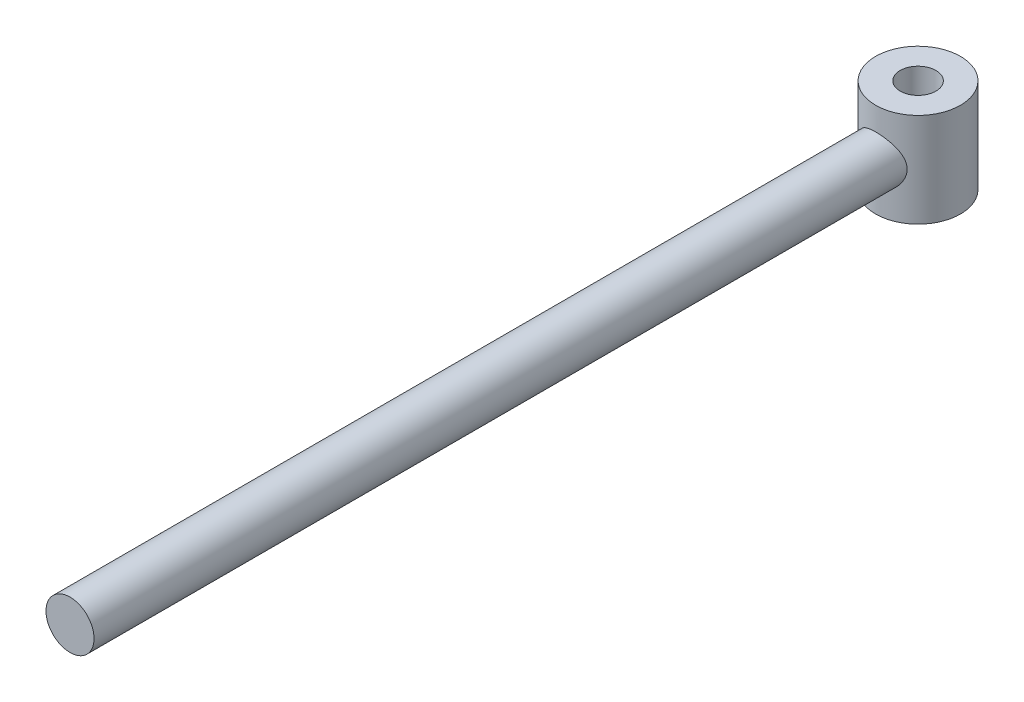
from build123d import *

# Parameters (mm, degrees)
SKETCH1_R               = 51
BOSS_EXTRUDE1_DEPTH     = 900
SKETCH2_R               = 90
BOSS_EXTRUDE2_DEPTH     = 100
CUT_EXTRUDE1_DEPTH      = 1015.001972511
CUT_EXTRUDE1_DEPTH_BACK = 1015.001972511
SKETCH3_R               = 38


with BuildPart() as part:
    # Sketch1 → Boss-Extrude1 (new, symmetric)
    with BuildSketch(Plane.XY):
        Circle(SKETCH1_R)
    extrude(amount=BOSS_EXTRUDE1_DEPTH, both=True)

    # Sketch2 → Boss-Extrude2 (add, symmetric)
    with BuildSketch(Plane(origin=(0, 0, 0), x_dir=(1, 0, 0), z_dir=(0, 1, 0))):
        with Locations(Location((0, 900, 0), (0, 0, 270))):
            Circle(SKETCH2_R)
    extrude(amount=BOSS_EXTRUDE2_DEPTH, both=True)

    # Sketch3 → Cut-Extrude1 (cut, two sides: drawn at the far end of the back side and taken through both)
    with BuildSketch(Plane(origin=(0, 100, 0), x_dir=(1, 0, 0), z_dir=(0, 1, 0)).offset(-CUT_EXTRUDE1_DEPTH_BACK)):
        with Locations(Location((0, 900, 0), (0, 0, 270))):
            Circle(SKETCH3_R)
    extrude(amount=CUT_EXTRUDE1_DEPTH + CUT_EXTRUDE1_DEPTH_BACK, mode=Mode.SUBTRACT)


solid = part.part
